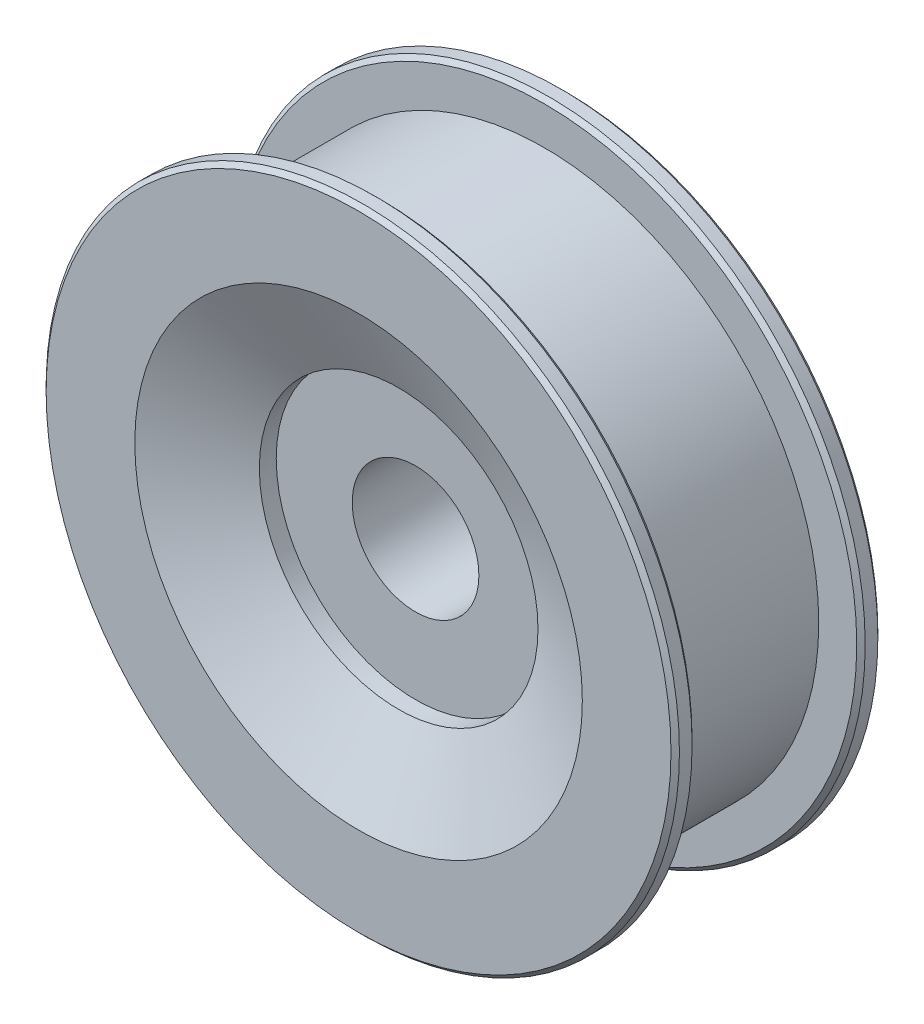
ISO-10303-21;
HEADER;
FILE_DESCRIPTION(('STEP AP214'),'2;1');
FILE_NAME('part.step','',(''),(''),'','','');
FILE_SCHEMA(('AUTOMOTIVE_DESIGN { 1 0 10303 214 1 1 1 1 }'));
ENDSEC;
DATA;
#1=APPLICATION_CONTEXT('core data for automotive mechanical design processes');
#2=APPLICATION_PROTOCOL_DEFINITION('international standard','automotive_design',2000,#1);
#3=PRODUCT_CONTEXT('',#1,'mechanical');
#4=PRODUCT('Part','Part','',(#3));
#5=PRODUCT_RELATED_PRODUCT_CATEGORY('part','',(#4));
#6=PRODUCT_DEFINITION_FORMATION('','',#4);
#7=PRODUCT_DEFINITION_CONTEXT('part definition',#1,'design');
#8=PRODUCT_DEFINITION('design','',#6,#7);
#9=PRODUCT_DEFINITION_SHAPE('','',#8);
#10=(LENGTH_UNIT() NAMED_UNIT(*) SI_UNIT(.MILLI.,.METRE.));
#11=(NAMED_UNIT(*) PLANE_ANGLE_UNIT() SI_UNIT($,.RADIAN.));
#12=(NAMED_UNIT(*) SI_UNIT($,.STERADIAN.) SOLID_ANGLE_UNIT());
#13=UNCERTAINTY_MEASURE_WITH_UNIT(LENGTH_MEASURE(1.E-05),#10,'distance_accuracy_value','');
#14=(GEOMETRIC_REPRESENTATION_CONTEXT(3) GLOBAL_UNCERTAINTY_ASSIGNED_CONTEXT((#13)) GLOBAL_UNIT_ASSIGNED_CONTEXT((#10,
#11,#12)) REPRESENTATION_CONTEXT('',''));
#15=CARTESIAN_POINT('',(0.,0.,0.));
#16=DIRECTION('',(0.,0.,1.));
#17=DIRECTION('',(1.,0.,0.));
#18=AXIS2_PLACEMENT_3D('',#15,#16,#17);
#19=CARTESIAN_POINT('',(0.,-7.5,-5.5));
#20=DIRECTION('',(0.,0.,-1.));
#21=DIRECTION('',(1.,0.,0.));
#22=AXIS2_PLACEMENT_3D('',#19,#20,#21);
#23=PLANE('',#22);
#24=CARTESIAN_POINT('',(0.,0.,-5.5));
#25=DIRECTION('',(0.,0.,-1.));
#26=DIRECTION('',(1.,0.,0.));
#27=AXIS2_PLACEMENT_3D('',#24,#25,#26);
#28=CIRCLE('',#27,16.5);
#29=CARTESIAN_POINT('',(16.5,0.,-5.5));
#30=VERTEX_POINT('',#29);
#31=EDGE_CURVE('E71',#30,#30,#28,.T.);
#32=ORIENTED_EDGE('',*,*,#31,.T.);
#33=EDGE_LOOP('',(#32));
#34=FACE_BOUND('',#33,.T.);
#35=CARTESIAN_POINT('',(0.,0.,-5.5));
#36=DIRECTION('',(0.,0.,-1.));
#37=DIRECTION('',(1.,0.,0.));
#38=AXIS2_PLACEMENT_3D('',#35,#36,#37);
#39=CIRCLE('',#38,7.5);
#40=CARTESIAN_POINT('',(7.5,0.,-5.5));
#41=VERTEX_POINT('',#40);
#42=EDGE_CURVE('E44',#41,#41,#39,.T.);
#43=ORIENTED_EDGE('',*,*,#42,.F.);
#44=EDGE_LOOP('',(#43));
#45=FACE_BOUND('',#44,.T.);
#46=ADVANCED_FACE('F12',(#34,#45),#23,.T.);
#47=CARTESIAN_POINT('',(0.,0.,-20.));
#48=DIRECTION('',(0.,0.,-1.));
#49=DIRECTION('',(1.,0.,0.));
#50=AXIS2_PLACEMENT_3D('',#47,#48,#49);
#51=CYLINDRICAL_SURFACE('',#50,7.5);
#52=ORIENTED_EDGE('',*,*,#42,.T.);
#53=EDGE_LOOP('',(#52));
#54=FACE_BOUND('',#53,.T.);
#55=CARTESIAN_POINT('',(0.,0.,5.5));
#56=DIRECTION('',(0.,0.,-1.));
#57=DIRECTION('',(1.,0.,0.));
#58=AXIS2_PLACEMENT_3D('',#55,#56,#57);
#59=CIRCLE('',#58,7.5);
#60=CARTESIAN_POINT('',(7.5,0.,5.5));
#61=VERTEX_POINT('',#60);
#62=EDGE_CURVE('E47',#61,#61,#59,.T.);
#63=ORIENTED_EDGE('',*,*,#62,.F.);
#64=EDGE_LOOP('',(#63));
#65=FACE_BOUND('',#64,.T.);
#66=ADVANCED_FACE('F96',(#54,#65),#51,.F.);
#67=CARTESIAN_POINT('',(0.,-7.5,5.5));
#68=DIRECTION('',(0.,0.,-1.));
#69=DIRECTION('',(1.,0.,0.));
#70=AXIS2_PLACEMENT_3D('',#67,#68,#69);
#71=PLANE('',#70);
#72=CARTESIAN_POINT('',(0.,0.,5.5));
#73=DIRECTION('',(0.,0.,-1.));
#74=DIRECTION('',(1.,0.,0.));
#75=AXIS2_PLACEMENT_3D('',#72,#73,#74);
#76=CIRCLE('',#75,16.5);
#77=CARTESIAN_POINT('',(16.5,0.,5.5));
#78=VERTEX_POINT('',#77);
#79=EDGE_CURVE('E50',#78,#78,#76,.T.);
#80=ORIENTED_EDGE('',*,*,#79,.F.);
#81=EDGE_LOOP('',(#80));
#82=FACE_BOUND('',#81,.T.);
#83=ORIENTED_EDGE('',*,*,#62,.T.);
#84=EDGE_LOOP('',(#83));
#85=FACE_BOUND('',#84,.T.);
#86=ADVANCED_FACE('F102',(#82,#85),#71,.F.);
#87=CARTESIAN_POINT('',(0.,0.,-20.));
#88=DIRECTION('',(0.,0.,-1.));
#89=DIRECTION('',(1.,0.,0.));
#90=AXIS2_PLACEMENT_3D('',#87,#88,#89);
#91=CYLINDRICAL_SURFACE('',#90,16.5);
#92=CARTESIAN_POINT('',(0.,0.,7.5));
#93=DIRECTION('',(0.,0.,-1.));
#94=DIRECTION('',(1.,0.,0.));
#95=AXIS2_PLACEMENT_3D('',#92,#93,#94);
#96=CIRCLE('',#95,16.5);
#97=CARTESIAN_POINT('',(16.5,0.,7.5));
#98=VERTEX_POINT('',#97);
#99=EDGE_CURVE('E53',#98,#98,#96,.T.);
#100=ORIENTED_EDGE('',*,*,#99,.F.);
#101=EDGE_LOOP('',(#100));
#102=FACE_BOUND('',#101,.T.);
#103=ORIENTED_EDGE('',*,*,#79,.T.);
#104=EDGE_LOOP('',(#103));
#105=FACE_BOUND('',#104,.T.);
#106=ADVANCED_FACE('F141',(#102,#105),#91,.F.);
#107=CARTESIAN_POINT('',(0.,0.,7.5));
#108=DIRECTION('',(0.,0.,1.));
#109=DIRECTION('',(-1.,0.,0.));
#110=AXIS2_PLACEMENT_3D('',#107,#108,#109);
#111=CONICAL_SURFACE('',#110,16.5,1.12734799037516);
#112=CARTESIAN_POINT('',(0.,0.,12.25));
#113=DIRECTION('',(0.,0.,-1.));
#114=DIRECTION('',(1.,0.,0.));
#115=AXIS2_PLACEMENT_3D('',#112,#113,#114);
#116=CIRCLE('',#115,26.5);
#117=CARTESIAN_POINT('',(26.5,0.,12.25));
#118=VERTEX_POINT('',#117);
#119=EDGE_CURVE('E56',#118,#118,#116,.T.);
#120=ORIENTED_EDGE('',*,*,#119,.F.);
#121=EDGE_LOOP('',(#120));
#122=FACE_BOUND('',#121,.T.);
#123=ORIENTED_EDGE('',*,*,#99,.T.);
#124=EDGE_LOOP('',(#123));
#125=FACE_BOUND('',#124,.T.);
#126=ADVANCED_FACE('F135',(#122,#125),#111,.F.);
#127=CARTESIAN_POINT('',(0.,-37.5,12.25));
#128=DIRECTION('',(0.,0.,1.));
#129=DIRECTION('',(-1.,0.,0.));
#130=AXIS2_PLACEMENT_3D('',#127,#128,#129);
#131=PLANE('',#130);
#132=CARTESIAN_POINT('',(0.,0.,12.25));
#133=DIRECTION('',(0.,0.,1.));
#134=DIRECTION('',(1.,0.,0.));
#135=AXIS2_PLACEMENT_3D('',#132,#133,#134);
#136=CIRCLE('',#135,37.);
#137=CARTESIAN_POINT('',(37.,0.,12.25));
#138=VERTEX_POINT('',#137);
#139=EDGE_CURVE('E19',#138,#138,#136,.T.);
#140=ORIENTED_EDGE('',*,*,#139,.T.);
#141=EDGE_LOOP('',(#140));
#142=FACE_BOUND('',#141,.T.);
#143=ORIENTED_EDGE('',*,*,#119,.T.);
#144=EDGE_LOOP('',(#143));
#145=FACE_BOUND('',#144,.T.);
#146=ADVANCED_FACE('F124',(#142,#145),#131,.T.);
#147=CARTESIAN_POINT('',(0.,0.,-20.));
#148=DIRECTION('',(0.,0.,-1.));
#149=DIRECTION('',(1.,0.,0.));
#150=AXIS2_PLACEMENT_3D('',#147,#148,#149);
#151=CYLINDRICAL_SURFACE('',#150,37.5);
#152=CARTESIAN_POINT('',(0.,0.,11.75));
#153=DIRECTION('',(0.,0.,1.));
#154=DIRECTION('',(1.,0.,0.));
#155=AXIS2_PLACEMENT_3D('',#152,#153,#154);
#156=CIRCLE('',#155,37.5);
#157=CARTESIAN_POINT('',(37.5,0.,11.75));
#158=VERTEX_POINT('',#157);
#159=EDGE_CURVE('E23',#158,#158,#156,.F.);
#160=ORIENTED_EDGE('',*,*,#159,.T.);
#161=EDGE_LOOP('',(#160));
#162=FACE_BOUND('',#161,.T.);
#163=CARTESIAN_POINT('',(0.,0.,10.25));
#164=DIRECTION('',(0.,0.,1.));
#165=DIRECTION('',(1.,0.,0.));
#166=AXIS2_PLACEMENT_3D('',#163,#164,#165);
#167=CIRCLE('',#166,37.5);
#168=CARTESIAN_POINT('',(37.5,0.,10.25));
#169=VERTEX_POINT('',#168);
#170=EDGE_CURVE('E27',#169,#169,#167,.T.);
#171=ORIENTED_EDGE('',*,*,#170,.T.);
#172=EDGE_LOOP('',(#171));
#173=FACE_BOUND('',#172,.T.);
#174=ADVANCED_FACE('F120',(#162,#173),#151,.T.);
#175=CARTESIAN_POINT('',(0.,-37.5,9.75));
#176=DIRECTION('',(0.,0.,1.));
#177=DIRECTION('',(-1.,0.,0.));
#178=AXIS2_PLACEMENT_3D('',#175,#176,#177);
#179=PLANE('',#178);
#180=CARTESIAN_POINT('',(0.,0.,9.75));
#181=DIRECTION('',(0.,0.,1.));
#182=DIRECTION('',(1.,0.,0.));
#183=AXIS2_PLACEMENT_3D('',#180,#181,#182);
#184=CIRCLE('',#183,37.);
#185=CARTESIAN_POINT('',(37.,0.,9.75));
#186=VERTEX_POINT('',#185);
#187=EDGE_CURVE('E8',#186,#186,#184,.F.);
#188=ORIENTED_EDGE('',*,*,#187,.T.);
#189=EDGE_LOOP('',(#188));
#190=FACE_BOUND('',#189,.T.);
#191=CARTESIAN_POINT('',(0.,0.,9.75));
#192=DIRECTION('',(0.,0.,-1.));
#193=DIRECTION('',(1.,0.,0.));
#194=AXIS2_PLACEMENT_3D('',#191,#192,#193);
#195=CIRCLE('',#194,32.5);
#196=CARTESIAN_POINT('',(32.5,0.,9.75));
#197=VERTEX_POINT('',#196);
#198=EDGE_CURVE('E59',#197,#197,#195,.T.);
#199=ORIENTED_EDGE('',*,*,#198,.F.);
#200=EDGE_LOOP('',(#199));
#201=FACE_BOUND('',#200,.T.);
#202=ADVANCED_FACE('F123',(#190,#201),#179,.F.);
#203=CARTESIAN_POINT('',(0.,0.,-20.));
#204=DIRECTION('',(0.,0.,-1.));
#205=DIRECTION('',(1.,0.,0.));
#206=AXIS2_PLACEMENT_3D('',#203,#204,#205);
#207=CYLINDRICAL_SURFACE('',#206,32.5);
#208=ORIENTED_EDGE('',*,*,#198,.T.);
#209=EDGE_LOOP('',(#208));
#210=FACE_BOUND('',#209,.T.);
#211=CARTESIAN_POINT('',(0.,0.,-9.75));
#212=DIRECTION('',(0.,0.,-1.));
#213=DIRECTION('',(1.,0.,0.));
#214=AXIS2_PLACEMENT_3D('',#211,#212,#213);
#215=CIRCLE('',#214,32.5);
#216=CARTESIAN_POINT('',(32.5,0.,-9.75));
#217=VERTEX_POINT('',#216);
#218=EDGE_CURVE('E62',#217,#217,#215,.T.);
#219=ORIENTED_EDGE('',*,*,#218,.F.);
#220=EDGE_LOOP('',(#219));
#221=FACE_BOUND('',#220,.T.);
#222=ADVANCED_FACE('F133',(#210,#221),#207,.T.);
#223=CARTESIAN_POINT('',(0.,-37.5,-9.75));
#224=DIRECTION('',(0.,0.,1.));
#225=DIRECTION('',(-1.,0.,0.));
#226=AXIS2_PLACEMENT_3D('',#223,#224,#225);
#227=PLANE('',#226);
#228=CARTESIAN_POINT('',(0.,0.,-9.75));
#229=DIRECTION('',(0.,0.,1.));
#230=DIRECTION('',(1.,0.,0.));
#231=AXIS2_PLACEMENT_3D('',#228,#229,#230);
#232=CIRCLE('',#231,37.);
#233=CARTESIAN_POINT('',(37.,0.,-9.75));
#234=VERTEX_POINT('',#233);
#235=EDGE_CURVE('E32',#234,#234,#232,.T.);
#236=ORIENTED_EDGE('',*,*,#235,.T.);
#237=EDGE_LOOP('',(#236));
#238=FACE_BOUND('',#237,.T.);
#239=ORIENTED_EDGE('',*,*,#218,.T.);
#240=EDGE_LOOP('',(#239));
#241=FACE_BOUND('',#240,.T.);
#242=ADVANCED_FACE('F245',(#238,#241),#227,.T.);
#243=CARTESIAN_POINT('',(0.,0.,-20.));
#244=DIRECTION('',(0.,0.,-1.));
#245=DIRECTION('',(1.,0.,0.));
#246=AXIS2_PLACEMENT_3D('',#243,#244,#245);
#247=CYLINDRICAL_SURFACE('',#246,37.5);
#248=CARTESIAN_POINT('',(0.,0.,-11.75));
#249=DIRECTION('',(0.,0.,1.));
#250=DIRECTION('',(1.,0.,0.));
#251=AXIS2_PLACEMENT_3D('',#248,#249,#250);
#252=CIRCLE('',#251,37.5);
#253=CARTESIAN_POINT('',(37.5,0.,-11.75));
#254=VERTEX_POINT('',#253);
#255=EDGE_CURVE('E35',#254,#254,#252,.T.);
#256=ORIENTED_EDGE('',*,*,#255,.T.);
#257=EDGE_LOOP('',(#256));
#258=FACE_BOUND('',#257,.T.);
#259=CARTESIAN_POINT('',(0.,0.,-10.25));
#260=DIRECTION('',(0.,0.,1.));
#261=DIRECTION('',(1.,0.,0.));
#262=AXIS2_PLACEMENT_3D('',#259,#260,#261);
#263=CIRCLE('',#262,37.5);
#264=CARTESIAN_POINT('',(37.5,0.,-10.25));
#265=VERTEX_POINT('',#264);
#266=EDGE_CURVE('E38',#265,#265,#263,.F.);
#267=ORIENTED_EDGE('',*,*,#266,.T.);
#268=EDGE_LOOP('',(#267));
#269=FACE_BOUND('',#268,.T.);
#270=ADVANCED_FACE('F237',(#258,#269),#247,.T.);
#271=CARTESIAN_POINT('',(0.,-37.5,-12.25));
#272=DIRECTION('',(0.,0.,1.));
#273=DIRECTION('',(-1.,0.,0.));
#274=AXIS2_PLACEMENT_3D('',#271,#272,#273);
#275=PLANE('',#274);
#276=CARTESIAN_POINT('',(0.,0.,-12.25));
#277=DIRECTION('',(0.,0.,1.));
#278=DIRECTION('',(1.,0.,0.));
#279=AXIS2_PLACEMENT_3D('',#276,#277,#278);
#280=CIRCLE('',#279,37.);
#281=CARTESIAN_POINT('',(37.,0.,-12.25));
#282=VERTEX_POINT('',#281);
#283=EDGE_CURVE('E41',#282,#282,#280,.F.);
#284=ORIENTED_EDGE('',*,*,#283,.T.);
#285=EDGE_LOOP('',(#284));
#286=FACE_BOUND('',#285,.T.);
#287=CARTESIAN_POINT('',(0.,0.,-12.25));
#288=DIRECTION('',(0.,0.,-1.));
#289=DIRECTION('',(1.,0.,0.));
#290=AXIS2_PLACEMENT_3D('',#287,#288,#289);
#291=CIRCLE('',#290,26.5);
#292=CARTESIAN_POINT('',(26.5,0.,-12.25));
#293=VERTEX_POINT('',#292);
#294=EDGE_CURVE('E65',#293,#293,#291,.T.);
#295=ORIENTED_EDGE('',*,*,#294,.F.);
#296=EDGE_LOOP('',(#295));
#297=FACE_BOUND('',#296,.T.);
#298=ADVANCED_FACE('F92',(#286,#297),#275,.F.);
#299=CARTESIAN_POINT('',(0.,0.,-7.5));
#300=DIRECTION('',(0.,0.,-1.));
#301=DIRECTION('',(1.,0.,0.));
#302=AXIS2_PLACEMENT_3D('',#299,#300,#301);
#303=CONICAL_SURFACE('',#302,16.5,1.12734799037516);
#304=ORIENTED_EDGE('',*,*,#294,.T.);
#305=EDGE_LOOP('',(#304));
#306=FACE_BOUND('',#305,.T.);
#307=CARTESIAN_POINT('',(0.,0.,-7.5));
#308=DIRECTION('',(0.,0.,-1.));
#309=DIRECTION('',(1.,0.,0.));
#310=AXIS2_PLACEMENT_3D('',#307,#308,#309);
#311=CIRCLE('',#310,16.5);
#312=CARTESIAN_POINT('',(16.5,0.,-7.5));
#313=VERTEX_POINT('',#312);
#314=EDGE_CURVE('E68',#313,#313,#311,.T.);
#315=ORIENTED_EDGE('',*,*,#314,.F.);
#316=EDGE_LOOP('',(#315));
#317=FACE_BOUND('',#316,.T.);
#318=ADVANCED_FACE('F80',(#306,#317),#303,.F.);
#319=CARTESIAN_POINT('',(0.,0.,-20.));
#320=DIRECTION('',(0.,0.,-1.));
#321=DIRECTION('',(1.,0.,0.));
#322=AXIS2_PLACEMENT_3D('',#319,#320,#321);
#323=CYLINDRICAL_SURFACE('',#322,16.5);
#324=ORIENTED_EDGE('',*,*,#314,.T.);
#325=EDGE_LOOP('',(#324));
#326=FACE_BOUND('',#325,.T.);
#327=ORIENTED_EDGE('',*,*,#31,.F.);
#328=EDGE_LOOP('',(#327));
#329=FACE_BOUND('',#328,.T.);
#330=ADVANCED_FACE('F77',(#326,#329),#323,.F.);
#331=CARTESIAN_POINT('',(0.,0.,-12.25));
#332=DIRECTION('',(0.,0.,1.));
#333=DIRECTION('',(1.,0.,0.));
#334=AXIS2_PLACEMENT_3D('',#331,#332,#333);
#335=CONICAL_SURFACE('',#334,37.,0.785398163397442);
#336=ORIENTED_EDGE('',*,*,#255,.F.);
#337=EDGE_LOOP('',(#336));
#338=FACE_BOUND('',#337,.T.);
#339=ORIENTED_EDGE('',*,*,#283,.F.);
#340=EDGE_LOOP('',(#339));
#341=FACE_BOUND('',#340,.T.);
#342=ADVANCED_FACE('F79',(#338,#341),#335,.T.);
#343=CARTESIAN_POINT('',(0.,0.,-10.25));
#344=DIRECTION('',(0.,0.,-1.));
#345=DIRECTION('',(-1.,0.,0.));
#346=AXIS2_PLACEMENT_3D('',#343,#344,#345);
#347=CONICAL_SURFACE('',#346,37.5,0.785398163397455);
#348=ORIENTED_EDGE('',*,*,#235,.F.);
#349=EDGE_LOOP('',(#348));
#350=FACE_BOUND('',#349,.T.);
#351=ORIENTED_EDGE('',*,*,#266,.F.);
#352=EDGE_LOOP('',(#351));
#353=FACE_BOUND('',#352,.T.);
#354=ADVANCED_FACE('F89',(#350,#353),#347,.T.);
#355=CARTESIAN_POINT('',(0.,0.,11.75));
#356=DIRECTION('',(0.,0.,-1.));
#357=DIRECTION('',(-1.,0.,0.));
#358=AXIS2_PLACEMENT_3D('',#355,#356,#357);
#359=CONICAL_SURFACE('',#358,37.5,0.785398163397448);
#360=ORIENTED_EDGE('',*,*,#139,.F.);
#361=EDGE_LOOP('',(#360));
#362=FACE_BOUND('',#361,.T.);
#363=ORIENTED_EDGE('',*,*,#159,.F.);
#364=EDGE_LOOP('',(#363));
#365=FACE_BOUND('',#364,.T.);
#366=ADVANCED_FACE('F108',(#362,#365),#359,.T.);
#367=CARTESIAN_POINT('',(0.,0.,9.75));
#368=DIRECTION('',(0.,0.,1.));
#369=DIRECTION('',(1.,0.,0.));
#370=AXIS2_PLACEMENT_3D('',#367,#368,#369);
#371=CONICAL_SURFACE('',#370,37.,0.785398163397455);
#372=ORIENTED_EDGE('',*,*,#170,.F.);
#373=EDGE_LOOP('',(#372));
#374=FACE_BOUND('',#373,.T.);
#375=ORIENTED_EDGE('',*,*,#187,.F.);
#376=EDGE_LOOP('',(#375));
#377=FACE_BOUND('',#376,.T.);
#378=ADVANCED_FACE('F14',(#374,#377),#371,.T.);
#379=CLOSED_SHELL('',(#46,#66,#86,#106,#126,#146,#174,#202,#222,#242,#270,#298,#318,#330,#342,
#354,#366,#378));
#380=MANIFOLD_SOLID_BREP('B1',#379);
#381=ADVANCED_BREP_SHAPE_REPRESENTATION('',(#18,#380),#14);
#382=SHAPE_DEFINITION_REPRESENTATION(#9,#381);
ENDSEC;
END-ISO-10303-21;
